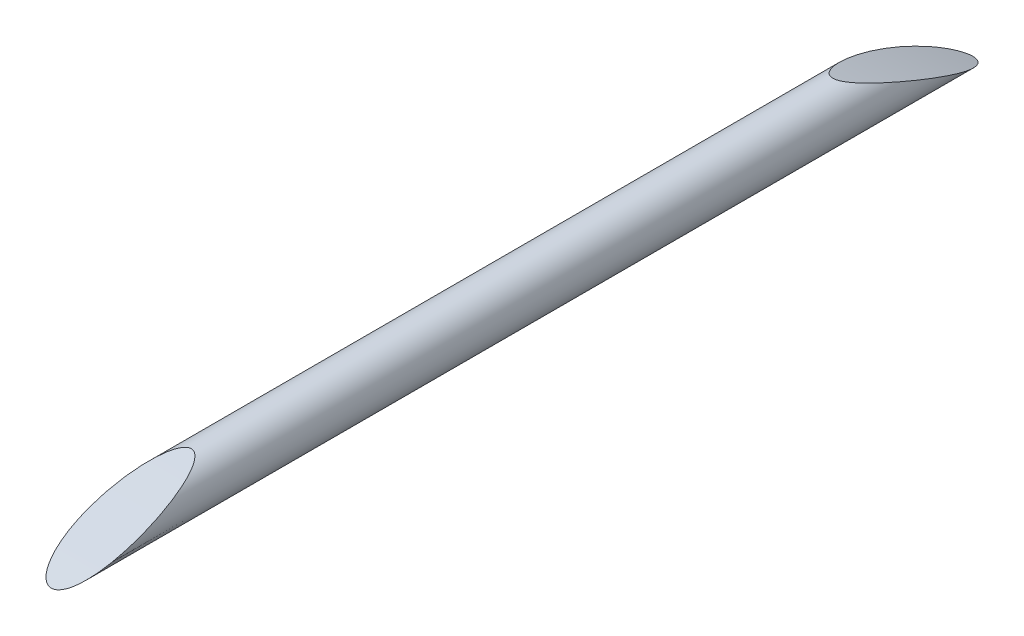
from build123d import *

# Parameters (mm, degrees)
ESQUISSE1_R                  = 0.5
BOSS_EXTRU_1_DEPTH           = 10.5
ENL_V_MAT_EXTRU_1_DEPTH      = 21
ENL_V_MAT_EXTRU_1_DEPTH_BACK = 21
ESQUISSE2_W                  = 83.816964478
ESQUISSE2_H                  = 65.999557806
ESQUISSE2_R                  = 22.5


with BuildPart() as part:
    # Esquisse1 → Boss.-Extru.1 (new, symmetric)
    with BuildSketch(Plane.XY):
        Circle(ESQUISSE1_R)
    extrude(amount=BOSS_EXTRU_1_DEPTH, both=True)

    # Esquisse2 → Enl_v. mat.-Extru.1 (cut, two sides: drawn at the far end of the back side and taken through both)
    with BuildSketch(Plane(origin=(0, 0, 0), x_dir=(0, 0, -1), z_dir=(1, 0, 0)).offset(-ENL_V_MAT_EXTRU_1_DEPTH_BACK)):
        with Locations((0, -21.099748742)):
            Rectangle(ESQUISSE2_W, ESQUISSE2_H)
        with Locations((0, -21.099748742)):
            Circle(ESQUISSE2_R, mode=Mode.SUBTRACT)
    extrude(amount=ENL_V_MAT_EXTRU_1_DEPTH + ENL_V_MAT_EXTRU_1_DEPTH_BACK, mode=Mode.SUBTRACT)


solid = part.part
